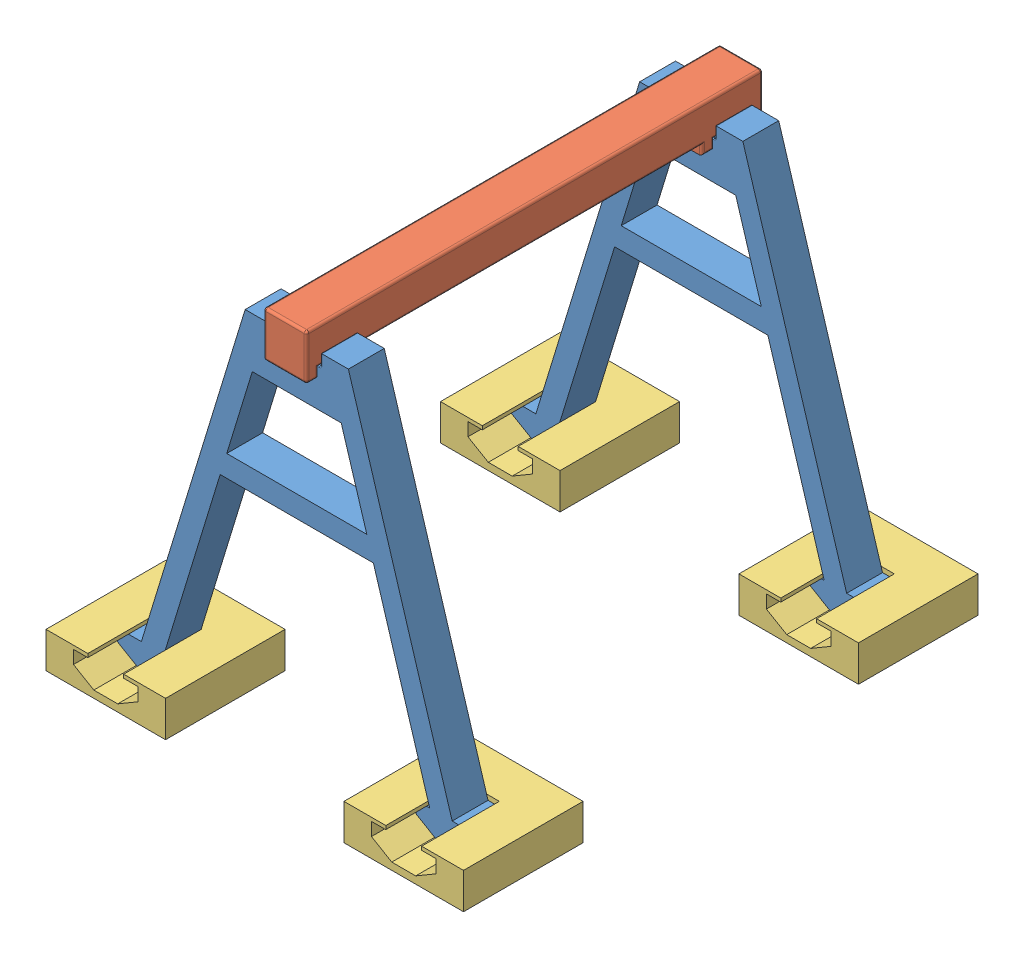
SolidWorks assembly Gentry Crane_Final.SLDASM, configuration Default (file format 12000). Lengths in mm.
Overall size (174.83 165 215).
7 component instances, 3 part files, 18 mates.
Components (placement in the parent):
- Support_Gentry Crane-1: Support_Gentry Crane.SLDPRT [Default] at (16.6449 43.1329 172.9684) size (150.03 152 15)
- Support_Gentry Crane-2: Support_Gentry Crane.SLDPRT [Default] at (16.6449 43.1329 337.9684) size (150.03 152 15)
- Beam_Gentry Crane-1: Beam_Gentry Crane.SLDPRT [Default] at (17.1449 195.1329 255.4684) x (0 0 -1) z (1 0 0) size (190.8 19 18)
- Base_Gentry Crane-1: Base_Gentry Crane.SLDPRT [Default] at (79.085 45.1329 172.9684) size (50 15 50)
- Base_Gentry Crane-2: Base_Gentry Crane.SLDPRT [Default] at (-45.745 45.1329 172.9684) size (50 15 50)
- Base_Gentry Crane-3: Base_Gentry Crane.SLDPRT [Default] at (-45.745 45.1329 337.9684) size (50 15 50)
- Base_Gentry Crane-4: Base_Gentry Crane.SLDPRT [Default] at (78.885 45.1329 337.9684) size (50 15 50)
Mates (geometry in assembly coordinates):
- Distance1: distance = 150 mm anti-aligned: plane of support_new-1 through (16.6449 43.1329 180.4684) normal (0 0 1); plane of support_new-2 through (16.6449 43.1329 330.4684) normal (0 0 -1)
- Coincident3: coincident aligned: plane of support_new-1 through (6.6449 205.1329 150.4684) normal (1 0 0); plane of support_new-2 through (6.6449 205.1329 315.4684) normal (1 0 0)
- Coincident4: coincident anti-aligned: plane of support_new-1 through (16.6449 43.1329 180.4684) normal (0 0 1); plane of beam_new-1 through (26.1449 191.1329 180.4684) normal (0 0 -1)
- Coincident5: coincident anti-aligned: plane of support_new-2 through (6.6449 195.1329 315.4684) normal (0 1 0); plane of beam_new-1 through (17.1449 195.1329 255.4684) normal (0 -1 0)
- Distance2: distance = 0.5 mm anti-aligned: plane of beam_new-1 through (26.1449 210.1329 350.8684) normal (1 0 0); plane of support_new-2 through (26.6449 205.1329 315.4684) normal (-1 0 0)
- Coincident6: coincident anti-aligned: plane of support_new-1 through (16.6449 43.1329 165.4684) normal (0 0 -1); plane of base-1 through (79.085 45.1329 165.4684) normal (0 0 1)
- Coincident7: coincident anti-aligned: plane of support_new-1 through (16.6449 48.1329 172.9684) normal (0 -1 0); plane of base-1 through (74.085 48.1329 165.4684) normal (0 1 0)
- Distance3: distance = 1 mm anti-aligned: plane of base-1 through (92.5835 58.6329 165.4684) normal (-1 0 0); plane of support_new-1 through (91.5835 43.1329 165.4684) normal (1 0 0)
- Coincident9: coincident anti-aligned: plane of support_new-1 through (16.6449 43.1329 165.4684) normal (0 0 -1); plane of base-2 through (-45.745 45.1329 165.4684) normal (0 0 1)
- Coincident10: coincident anti-aligned: plane of support_new-1 through (16.6449 48.1329 172.9684) normal (0 -1 0); plane of base-2 through (-50.745 48.1329 165.4684) normal (0 1 0)
- Distance4: distance = 1.2 mm anti-aligned: plane of base-2 through (-32.2465 58.6329 165.4684) normal (-1 0 0); plane of support_new-1 through (-33.4465 43.1329 165.4684) normal (1 0 0)
- Coincident12: coincident anti-aligned: plane of support_new-2 through (16.6449 43.1329 330.4684) normal (0 0 -1); plane of base-3 through (-45.745 45.1329 330.4684) normal (0 0 1)
- Coincident13: coincident anti-aligned: plane of support_new-2 through (16.6449 48.1329 337.9684) normal (0 -1 0); plane of base-3 through (-50.745 48.1329 330.4684) normal (0 1 0)
- Distance5: distance = 1.2 mm anti-aligned: plane of base-3 through (-32.2465 58.6329 330.4684) normal (-1 0 0); plane of support_new-2 through (-33.4465 43.1329 330.4684) normal (1 0 0)
- Coincident15: coincident anti-aligned: plane of support_new-2 through (16.6449 43.1329 330.4684) normal (0 0 -1); plane of base-4 through (78.885 45.1329 330.4684) normal (0 0 1)
- Coincident16: coincident anti-aligned: plane of support_new-2 through (16.6449 48.1329 337.9684) normal (0 -1 0); plane of base-4 through (73.885 48.1329 330.4684) normal (0 1 0)
- Distance6: distance = 0.8 mm anti-aligned: plane of base-4 through (92.3835 58.6329 330.4684) normal (-1 0 0); plane of support_new-2 through (91.5835 43.1329 330.4684) normal (1 0 0)
- Coincident18: coincident anti-aligned: plane of support_new-1 through (6.6449 195.1329 150.4684) normal (0 1 0); plane of beam_new-1 through (17.1449 195.1329 255.4684) normal (0 -1 0)
